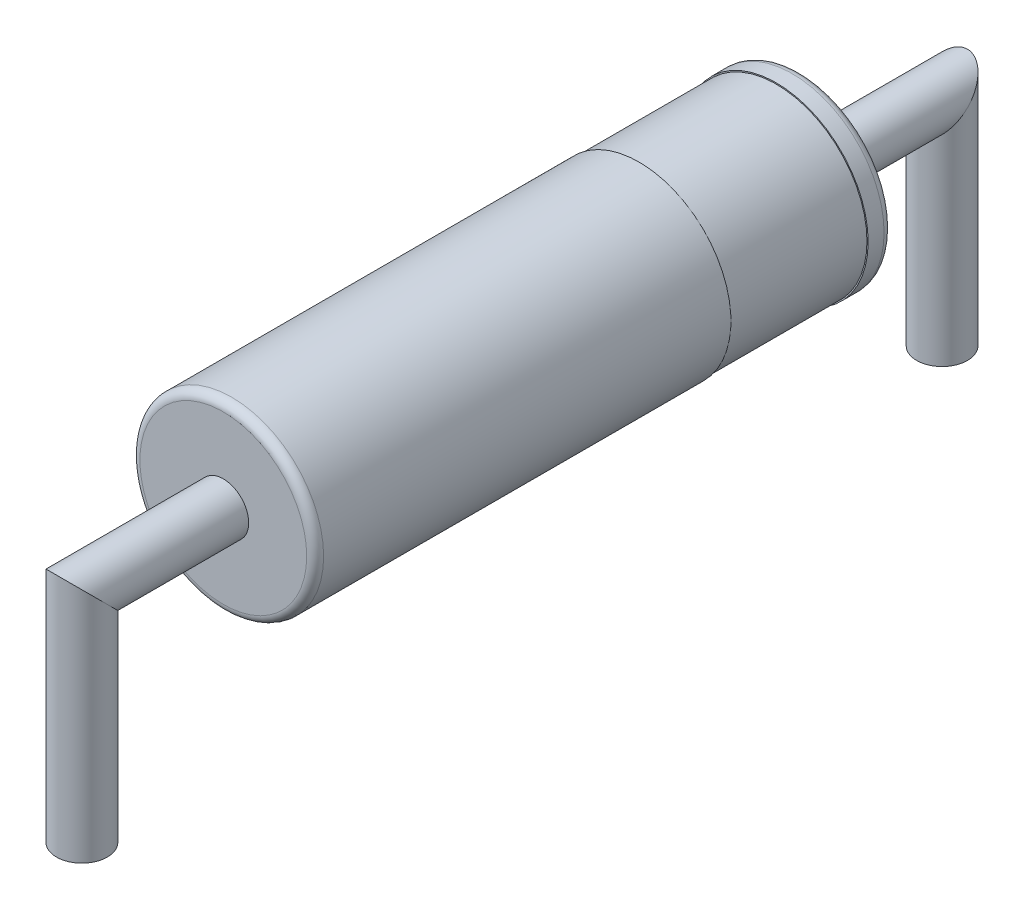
ISO-10303-21;
HEADER;
FILE_DESCRIPTION(('STEP AP214'),'2;1');
FILE_NAME('part.step','',(''),(''),'','','');
FILE_SCHEMA(('AUTOMOTIVE_DESIGN { 1 0 10303 214 1 1 1 1 }'));
ENDSEC;
DATA;
#1=APPLICATION_CONTEXT('core data for automotive mechanical design processes');
#2=APPLICATION_PROTOCOL_DEFINITION('international standard','automotive_design',2000,#1);
#3=PRODUCT_CONTEXT('',#1,'mechanical');
#4=PRODUCT('Part','Part','',(#3));
#5=PRODUCT_RELATED_PRODUCT_CATEGORY('part','',(#4));
#6=PRODUCT_DEFINITION_FORMATION('','',#4);
#7=PRODUCT_DEFINITION_CONTEXT('part definition',#1,'design');
#8=PRODUCT_DEFINITION('design','',#6,#7);
#9=PRODUCT_DEFINITION_SHAPE('','',#8);
#10=(LENGTH_UNIT() NAMED_UNIT(*) SI_UNIT(.MILLI.,.METRE.));
#11=(NAMED_UNIT(*) PLANE_ANGLE_UNIT() SI_UNIT($,.RADIAN.));
#12=(NAMED_UNIT(*) SI_UNIT($,.STERADIAN.) SOLID_ANGLE_UNIT());
#13=UNCERTAINTY_MEASURE_WITH_UNIT(LENGTH_MEASURE(1.E-05),#10,'distance_accuracy_value','');
#14=(GEOMETRIC_REPRESENTATION_CONTEXT(3) GLOBAL_UNCERTAINTY_ASSIGNED_CONTEXT((#13)) GLOBAL_UNIT_ASSIGNED_CONTEXT((#10,
#11,#12)) REPRESENTATION_CONTEXT('',''));
#15=CARTESIAN_POINT('',(0.,0.,0.));
#16=DIRECTION('',(0.,0.,1.));
#17=DIRECTION('',(1.,0.,0.));
#18=AXIS2_PLACEMENT_3D('',#15,#16,#17);
#19=CARTESIAN_POINT('',(0.,0.,3.41));
#20=DIRECTION('',(0.,0.,-1.));
#21=DIRECTION('',(-1.,0.,0.));
#22=AXIS2_PLACEMENT_3D('',#19,#20,#21);
#23=CYLINDRICAL_SURFACE('',#22,1.085);
#24=CARTESIAN_POINT('',(0.,0.,-3.31));
#25=DIRECTION('',(0.,0.,1.));
#26=DIRECTION('',(1.,0.,0.));
#27=AXIS2_PLACEMENT_3D('',#24,#25,#26);
#28=CIRCLE('',#27,1.085);
#29=CARTESIAN_POINT('',(1.085,0.,-3.31));
#30=VERTEX_POINT('',#29);
#31=EDGE_CURVE('E83',#30,#30,#28,.T.);
#32=ORIENTED_EDGE('',*,*,#31,.T.);
#33=EDGE_LOOP('',(#32));
#34=FACE_BOUND('',#33,.T.);
#35=CARTESIAN_POINT('',(0.,0.,-3.12192987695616));
#36=DIRECTION('',(0.,0.,1.));
#37=DIRECTION('',(1.,0.,0.));
#38=AXIS2_PLACEMENT_3D('',#35,#36,#37);
#39=CIRCLE('',#38,1.085);
#40=CARTESIAN_POINT('',(1.085,0.,-3.12192987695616));
#41=VERTEX_POINT('',#40);
#42=EDGE_CURVE('E42',#41,#41,#39,.T.);
#43=ORIENTED_EDGE('',*,*,#42,.F.);
#44=EDGE_LOOP('',(#43));
#45=FACE_BOUND('',#44,.T.);
#46=ADVANCED_FACE('F39',(#34,#45),#23,.T.);
#47=CARTESIAN_POINT('',(0.,0.,-3.41));
#48=DIRECTION('',(0.,0.,1.));
#49=DIRECTION('',(1.,0.,0.));
#50=AXIS2_PLACEMENT_3D('',#47,#48,#49);
#51=PLANE('',#50);
#52=CARTESIAN_POINT('',(0.,0.,-3.41));
#53=DIRECTION('',(0.,0.,1.));
#54=DIRECTION('',(1.,0.,0.));
#55=AXIS2_PLACEMENT_3D('',#52,#53,#54);
#56=CIRCLE('',#55,0.985);
#57=CARTESIAN_POINT('',(0.985,0.,-3.41));
#58=VERTEX_POINT('',#57);
#59=EDGE_CURVE('E51',#58,#58,#56,.F.);
#60=ORIENTED_EDGE('',*,*,#59,.T.);
#61=EDGE_LOOP('',(#60));
#62=FACE_BOUND('',#61,.T.);
#63=CARTESIAN_POINT('',(0.,0.,-3.41));
#64=DIRECTION('',(0.,0.,1.));
#65=DIRECTION('',(1.,0.,0.));
#66=AXIS2_PLACEMENT_3D('',#63,#64,#65);
#67=CIRCLE('',#66,0.3);
#68=CARTESIAN_POINT('',(0.3,0.,-3.41));
#69=VERTEX_POINT('',#68);
#70=EDGE_CURVE('E46',#69,#69,#67,.F.);
#71=ORIENTED_EDGE('',*,*,#70,.F.);
#72=EDGE_LOOP('',(#71));
#73=FACE_BOUND('',#72,.T.);
#74=ADVANCED_FACE('F91',(#62,#73),#51,.F.);
#75=CARTESIAN_POINT('',(0.,0.,-3.31));
#76=DIRECTION('',(0.,0.,1.));
#77=DIRECTION('',(1.,0.,0.));
#78=AXIS2_PLACEMENT_3D('',#75,#76,#77);
#79=TOROIDAL_SURFACE('',#78,0.985,0.1);
#80=ORIENTED_EDGE('',*,*,#59,.F.);
#81=EDGE_LOOP('',(#80));
#82=FACE_BOUND('',#81,.T.);
#83=ORIENTED_EDGE('',*,*,#31,.F.);
#84=EDGE_LOOP('',(#83));
#85=FACE_BOUND('',#84,.T.);
#86=ADVANCED_FACE('F94',(#82,#85),#79,.T.);
#87=CARTESIAN_POINT('',(0.,0.,-5.08));
#88=DIRECTION('',(0.,-1.,0.));
#89=DIRECTION('',(0.,0.,-1.));
#90=AXIS2_PLACEMENT_3D('',#87,#88,#89);
#91=CYLINDRICAL_SURFACE('',#90,0.3);
#92=CARTESIAN_POINT('',(0.,0.,-5.08));
#93=DIRECTION('',(0.,-0.707106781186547,-0.707106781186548));
#94=DIRECTION('',(0.,-0.707106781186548,0.707106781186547));
#95=AXIS2_PLACEMENT_3D('',#92,#93,#94);
#96=ELLIPSE('',#95,0.424264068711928,0.3);
#97=CARTESIAN_POINT('',(0.,-0.3,-4.78));
#98=VERTEX_POINT('',#97);
#99=EDGE_CURVE('E74',#98,#98,#96,.T.);
#100=ORIENTED_EDGE('',*,*,#99,.T.);
#101=EDGE_LOOP('',(#100));
#102=FACE_BOUND('',#101,.T.);
#103=CARTESIAN_POINT('',(0.,-2.585,-5.08));
#104=DIRECTION('',(0.,-1.,0.));
#105=DIRECTION('',(0.,0.,-1.));
#106=AXIS2_PLACEMENT_3D('',#103,#104,#105);
#107=CIRCLE('',#106,0.3);
#108=CARTESIAN_POINT('',(0.,-2.585,-5.38));
#109=VERTEX_POINT('',#108);
#110=EDGE_CURVE('E77',#109,#109,#107,.F.);
#111=ORIENTED_EDGE('',*,*,#110,.T.);
#112=EDGE_LOOP('',(#111));
#113=FACE_BOUND('',#112,.T.);
#114=ADVANCED_FACE('F97',(#102,#113),#91,.T.);
#115=CARTESIAN_POINT('',(0.,0.,-5.92852813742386));
#116=DIRECTION('',(0.,0.,1.));
#117=DIRECTION('',(1.,0.,0.));
#118=AXIS2_PLACEMENT_3D('',#115,#116,#117);
#119=CYLINDRICAL_SURFACE('',#118,0.3);
#120=ORIENTED_EDGE('',*,*,#70,.T.);
#121=EDGE_LOOP('',(#120));
#122=FACE_BOUND('',#121,.T.);
#123=ORIENTED_EDGE('',*,*,#99,.F.);
#124=EDGE_LOOP('',(#123));
#125=FACE_BOUND('',#124,.T.);
#126=ADVANCED_FACE('F119',(#122,#125),#119,.T.);
#127=CARTESIAN_POINT('',(0.,-2.585,-5.08));
#128=DIRECTION('',(0.,-1.,0.));
#129=DIRECTION('',(0.,0.,-1.));
#130=AXIS2_PLACEMENT_3D('',#127,#128,#129);
#131=PLANE('',#130);
#132=ORIENTED_EDGE('',*,*,#110,.F.);
#133=EDGE_LOOP('',(#132));
#134=FACE_BOUND('',#133,.T.);
#135=ADVANCED_FACE('F109',(#134),#131,.T.);
#136=CARTESIAN_POINT('',(0.,1.1535467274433,-3.12192987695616));
#137=DIRECTION('',(0.,0.,1.));
#138=DIRECTION('',(1.,0.,0.));
#139=AXIS2_PLACEMENT_3D('',#136,#137,#138);
#140=PLANE('',#139);
#141=CARTESIAN_POINT('',(0.,0.,-3.12192987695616));
#142=DIRECTION('',(0.,0.,1.));
#143=DIRECTION('',(1.,0.,0.));
#144=AXIS2_PLACEMENT_3D('',#141,#142,#143);
#145=CIRCLE('',#144,1.07091797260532);
#146=CARTESIAN_POINT('',(1.07091797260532,0.,-3.12192987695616));
#147=VERTEX_POINT('',#146);
#148=EDGE_CURVE('E56',#147,#147,#145,.T.);
#149=ORIENTED_EDGE('',*,*,#148,.F.);
#150=EDGE_LOOP('',(#149));
#151=FACE_BOUND('',#150,.T.);
#152=ORIENTED_EDGE('',*,*,#42,.T.);
#153=EDGE_LOOP('',(#152));
#154=FACE_BOUND('',#153,.T.);
#155=ADVANCED_FACE('F106',(#151,#154),#140,.T.);
#156=CARTESIAN_POINT('',(0.,1.1535467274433,-1.50082726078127));
#157=DIRECTION('',(0.,0.,-1.));
#158=DIRECTION('',(-1.,0.,0.));
#159=AXIS2_PLACEMENT_3D('',#156,#157,#158);
#160=PLANE('',#159);
#161=CARTESIAN_POINT('',(0.,0.,-1.50082726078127));
#162=DIRECTION('',(0.,0.,1.));
#163=DIRECTION('',(1.,0.,0.));
#164=AXIS2_PLACEMENT_3D('',#161,#162,#163);
#165=CIRCLE('',#164,1.07091797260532);
#166=CARTESIAN_POINT('',(1.07091797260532,0.,-1.50082726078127));
#167=VERTEX_POINT('',#166);
#168=EDGE_CURVE('E62',#167,#167,#165,.T.);
#169=ORIENTED_EDGE('',*,*,#168,.T.);
#170=EDGE_LOOP('',(#169));
#171=FACE_BOUND('',#170,.T.);
#172=CARTESIAN_POINT('',(0.,0.,-1.50082726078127));
#173=DIRECTION('',(0.,0.,-1.));
#174=DIRECTION('',(-1.,0.,0.));
#175=AXIS2_PLACEMENT_3D('',#172,#173,#174);
#176=CIRCLE('',#175,1.085);
#177=CARTESIAN_POINT('',(-1.085,0.,-1.50082726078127));
#178=VERTEX_POINT('',#177);
#179=EDGE_CURVE('E54',#178,#178,#176,.T.);
#180=ORIENTED_EDGE('',*,*,#179,.T.);
#181=EDGE_LOOP('',(#180));
#182=FACE_BOUND('',#181,.T.);
#183=ADVANCED_FACE('F108',(#171,#182),#160,.T.);
#184=CARTESIAN_POINT('',(0.,0.,0.));
#185=DIRECTION('',(0.,0.,1.));
#186=DIRECTION('',(1.,0.,0.));
#187=AXIS2_PLACEMENT_3D('',#184,#185,#186);
#188=CYLINDRICAL_SURFACE('',#187,1.07091797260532);
#189=ORIENTED_EDGE('',*,*,#148,.T.);
#190=EDGE_LOOP('',(#189));
#191=FACE_BOUND('',#190,.T.);
#192=ORIENTED_EDGE('',*,*,#168,.F.);
#193=EDGE_LOOP('',(#192));
#194=FACE_BOUND('',#193,.T.);
#195=ADVANCED_FACE('F116',(#191,#194),#188,.T.);
#196=CARTESIAN_POINT('',(0.,-2.585,5.08));
#197=DIRECTION('',(0.,-1.,0.));
#198=DIRECTION('',(0.,0.,-1.));
#199=AXIS2_PLACEMENT_3D('',#196,#197,#198);
#200=PLANE('',#199);
#201=CARTESIAN_POINT('',(0.,-2.585,5.08));
#202=DIRECTION('',(0.,-1.,0.));
#203=DIRECTION('',(0.,0.,-1.));
#204=AXIS2_PLACEMENT_3D('',#201,#202,#203);
#205=CIRCLE('',#204,0.3);
#206=CARTESIAN_POINT('',(0.,-2.585,4.78));
#207=VERTEX_POINT('',#206);
#208=EDGE_CURVE('E71',#207,#207,#205,.T.);
#209=ORIENTED_EDGE('',*,*,#208,.T.);
#210=EDGE_LOOP('',(#209));
#211=FACE_BOUND('',#210,.T.);
#212=ADVANCED_FACE('F124',(#211),#200,.T.);
#213=CARTESIAN_POINT('',(0.,0.,5.08));
#214=DIRECTION('',(0.,-1.,0.));
#215=DIRECTION('',(0.,0.,-1.));
#216=AXIS2_PLACEMENT_3D('',#213,#214,#215);
#217=CYLINDRICAL_SURFACE('',#216,0.3);
#218=CARTESIAN_POINT('',(0.,0.,5.08));
#219=DIRECTION('',(0.,-0.707106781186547,0.707106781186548));
#220=DIRECTION('',(0.,-0.707106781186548,-0.707106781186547));
#221=AXIS2_PLACEMENT_3D('',#218,#219,#220);
#222=ELLIPSE('',#221,0.424264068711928,0.3);
#223=CARTESIAN_POINT('',(0.,-0.3,4.78));
#224=VERTEX_POINT('',#223);
#225=EDGE_CURVE('E60',#224,#224,#222,.F.);
#226=ORIENTED_EDGE('',*,*,#225,.F.);
#227=EDGE_LOOP('',(#226));
#228=FACE_BOUND('',#227,.T.);
#229=ORIENTED_EDGE('',*,*,#208,.F.);
#230=EDGE_LOOP('',(#229));
#231=FACE_BOUND('',#230,.T.);
#232=ADVANCED_FACE('F127',(#228,#231),#217,.T.);
#233=CARTESIAN_POINT('',(0.,0.,5.92852813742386));
#234=DIRECTION('',(0.,0.,-1.));
#235=DIRECTION('',(-1.,0.,0.));
#236=AXIS2_PLACEMENT_3D('',#233,#234,#235);
#237=CYLINDRICAL_SURFACE('',#236,0.3);
#238=CARTESIAN_POINT('',(0.,0.,3.41));
#239=DIRECTION('',(0.,0.,1.));
#240=DIRECTION('',(1.,0.,0.));
#241=AXIS2_PLACEMENT_3D('',#238,#239,#240);
#242=CIRCLE('',#241,0.3);
#243=CARTESIAN_POINT('',(0.3,0.,3.41));
#244=VERTEX_POINT('',#243);
#245=EDGE_CURVE('E11',#244,#244,#242,.T.);
#246=ORIENTED_EDGE('',*,*,#245,.T.);
#247=EDGE_LOOP('',(#246));
#248=FACE_BOUND('',#247,.T.);
#249=ORIENTED_EDGE('',*,*,#225,.T.);
#250=EDGE_LOOP('',(#249));
#251=FACE_BOUND('',#250,.T.);
#252=ADVANCED_FACE('F129',(#248,#251),#237,.T.);
#253=CARTESIAN_POINT('',(0.,0.,3.41));
#254=DIRECTION('',(0.,0.,1.));
#255=DIRECTION('',(1.,0.,0.));
#256=AXIS2_PLACEMENT_3D('',#253,#254,#255);
#257=PLANE('',#256);
#258=ORIENTED_EDGE('',*,*,#245,.F.);
#259=EDGE_LOOP('',(#258));
#260=FACE_BOUND('',#259,.T.);
#261=CARTESIAN_POINT('',(0.,0.,3.41));
#262=DIRECTION('',(0.,0.,1.));
#263=DIRECTION('',(1.,0.,0.));
#264=AXIS2_PLACEMENT_3D('',#261,#262,#263);
#265=CIRCLE('',#264,0.985);
#266=CARTESIAN_POINT('',(0.985,0.,3.41));
#267=VERTEX_POINT('',#266);
#268=EDGE_CURVE('E80',#267,#267,#265,.T.);
#269=ORIENTED_EDGE('',*,*,#268,.T.);
#270=EDGE_LOOP('',(#269));
#271=FACE_BOUND('',#270,.T.);
#272=ADVANCED_FACE('F132',(#260,#271),#257,.T.);
#273=CARTESIAN_POINT('',(0.,0.,3.31));
#274=DIRECTION('',(0.,0.,1.));
#275=DIRECTION('',(1.,0.,0.));
#276=AXIS2_PLACEMENT_3D('',#273,#274,#275);
#277=TOROIDAL_SURFACE('',#276,0.985,0.1);
#278=CARTESIAN_POINT('',(0.,0.,3.31));
#279=DIRECTION('',(0.,0.,1.));
#280=DIRECTION('',(1.,0.,0.));
#281=AXIS2_PLACEMENT_3D('',#278,#279,#280);
#282=CIRCLE('',#281,1.085);
#283=CARTESIAN_POINT('',(1.085,0.,3.31));
#284=VERTEX_POINT('',#283);
#285=EDGE_CURVE('E86',#284,#284,#282,.F.);
#286=ORIENTED_EDGE('',*,*,#285,.F.);
#287=EDGE_LOOP('',(#286));
#288=FACE_BOUND('',#287,.T.);
#289=ORIENTED_EDGE('',*,*,#268,.F.);
#290=EDGE_LOOP('',(#289));
#291=FACE_BOUND('',#290,.T.);
#292=ADVANCED_FACE('F142',(#288,#291),#277,.T.);
#293=ORIENTED_EDGE('',*,*,#285,.T.);
#294=EDGE_LOOP('',(#293));
#295=FACE_BOUND('',#294,.T.);
#296=ORIENTED_EDGE('',*,*,#179,.F.);
#297=EDGE_LOOP('',(#296));
#298=FACE_BOUND('',#297,.T.);
#299=ADVANCED_FACE('F103',(#295,#298),#23,.T.);
#300=CLOSED_SHELL('',(#46,#74,#86,#114,#126,#135,#155,#183,#195,#212,#232,#252,#272,#292,#299));
#301=MANIFOLD_SOLID_BREP('B2',#300);
#302=ADVANCED_BREP_SHAPE_REPRESENTATION('',(#18,#301),#14);
#303=SHAPE_DEFINITION_REPRESENTATION(#9,#302);
ENDSEC;
END-ISO-10303-21;
